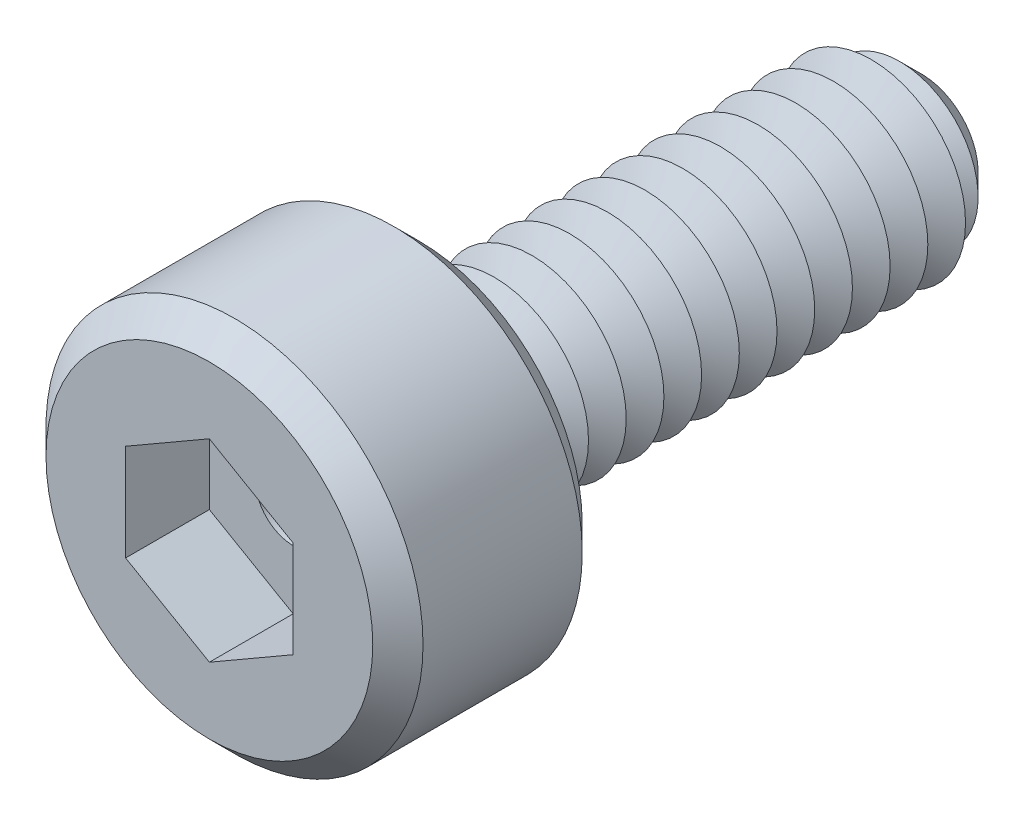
from build123d import *

# Parameters (mm, degrees)
SKETCH1_R           = 2.25
BOSS_EXTRUDE1_DEPTH = 2.5
SKETCH2_R           = 1.125
BOSS_EXTRUDE2_DEPTH = 6
CHAMFER1_SIZE       = 0.45
LPATTERN1_COUNT     = 13
LPATTERN1_PITCH     = 0.45
CUT_EXTRUDE1_DEPTH  = 1
SKETCH6_R           = 0.45
CUT_EXTRUDE2_DEPTH  = 7.5
CHAMFER2_SIZE       = 0.3


with BuildPart() as part:
    # Sketch1 → Boss-Extrude1 (new body)
    with BuildSketch(Plane.XY):
        Circle(SKETCH1_R)
    extrude(amount=BOSS_EXTRUDE1_DEPTH)

    # Sketch2 → Boss-Extrude2 (add)
    with BuildSketch(Plane(origin=(0, 0, 0), x_dir=(-1, 0, 0), z_dir=(0, 0, -1))):
        Circle(SKETCH2_R)
    extrude(amount=BOSS_EXTRUDE2_DEPTH)

    # Chamfer1
    chamfer1_edges = [part.edges().sort_by_distance(p)[0] for p in [
        (1.125, 0, -6),
    ]]
    chamfer(chamfer1_edges, length=CHAMFER1_SIZE)

    # Sketch4 → Cut-Revolve1 (revolve, cut)
    with BuildSketch(Plane(origin=(0, 0, 0), x_dir=(0, 0, -1), z_dir=(1, 0, 0)), mode=Mode.PRIVATE) as cut_revolve1_sk:
        Polygon((0, 1.125), (0.225, 0.735288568), (0.45, 1.125), align=None)
    cut_revolve1 = revolve(cut_revolve1_sk.sketch.rotate(Axis((0, 0, 2.512122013), (0, 0, -1)), 90), axis=Axis((0, 0, 2.512122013), (0, 0, -1)), mode=Mode.SUBTRACT)

    # LPattern1: Cut-Revolve1 ×13
    with Locations(*[(0, 0, -i * LPATTERN1_PITCH) for i in range(1, LPATTERN1_COUNT)]):
        add(cut_revolve1, mode=Mode.SUBTRACT)

    # Sketch5 → Cut-Extrude1 (cut)
    with BuildSketch(Plane.XY.offset(2.5)):
        Polygon((0, 1.154700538), (-1, 0.577350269), (-1, -0.577350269), (0, -1.154700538), (1, -0.577350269), (1, 0.577350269), align=None)
    extrude(amount=-CUT_EXTRUDE1_DEPTH, mode=Mode.SUBTRACT)

    # Sketch6 → Cut-Extrude2 (cut)
    with BuildSketch(Plane.XY.offset(1.5)):
        Circle(SKETCH6_R)
    extrude(amount=-CUT_EXTRUDE2_DEPTH, mode=Mode.SUBTRACT)

    # Chamfer2
    chamfer2_edges = [part.edges().sort_by_distance(p)[0] for p in [
        (-2.25, 0, 0),
        (-2.25, 0, 2.5),
    ]]
    chamfer(chamfer2_edges, length=CHAMFER2_SIZE)


solid = part.part
